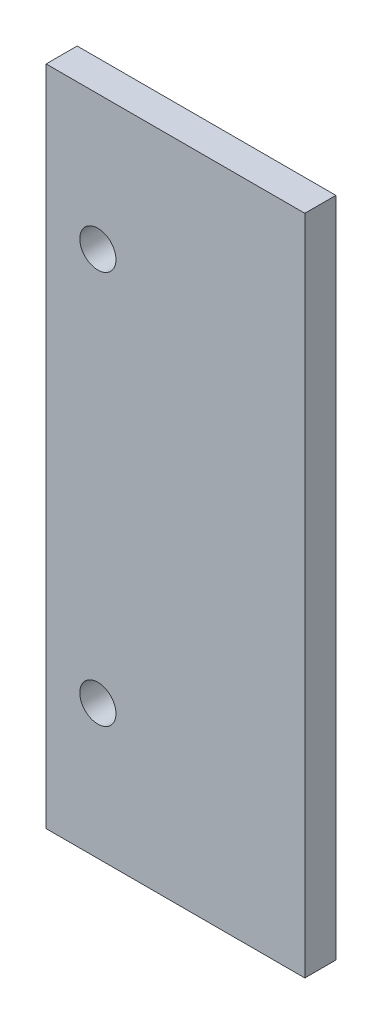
from build123d import *

# Parameters (mm, degrees)
SKETCH1_W      = 25
SKETCH1_H      = 64
SKETCH1_R      = 1.75
EXTRUDE1_DEPTH = 3


with BuildPart() as part:
    # Sketch1 → Extrude1 (new body)
    with BuildSketch(Plane.XY):
        with Locations((12.5, 32)):
            Rectangle(SKETCH1_W, SKETCH1_H)
        with Locations((5, 51)):
            Circle(SKETCH1_R, mode=Mode.SUBTRACT)
        with Locations((5, 13)):
            Circle(SKETCH1_R, mode=Mode.SUBTRACT)
    extrude(amount=EXTRUDE1_DEPTH)


solid = part.part
